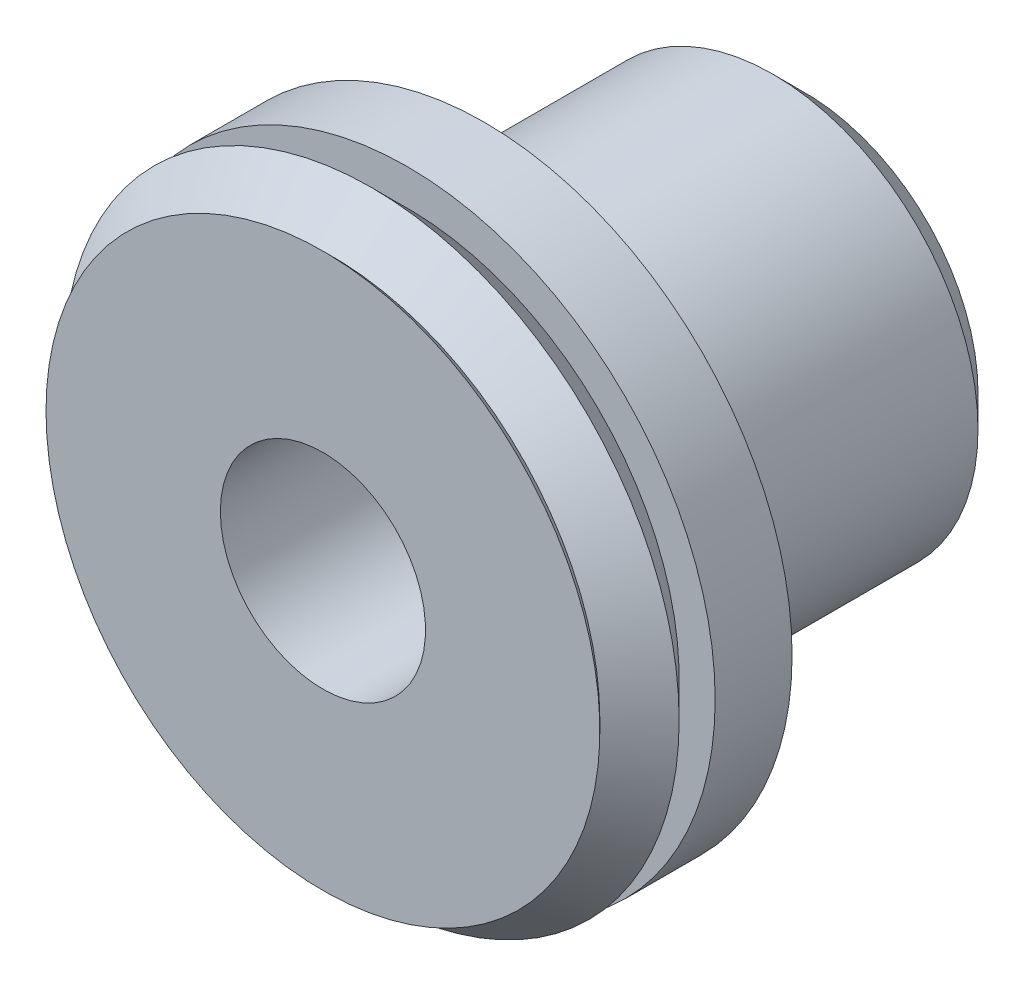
ISO-10303-21;
HEADER;
FILE_DESCRIPTION(('STEP AP214'),'2;1');
FILE_NAME('part.step','',(''),(''),'','','');
FILE_SCHEMA(('AUTOMOTIVE_DESIGN { 1 0 10303 214 1 1 1 1 }'));
ENDSEC;
DATA;
#1=APPLICATION_CONTEXT('core data for automotive mechanical design processes');
#2=APPLICATION_PROTOCOL_DEFINITION('international standard','automotive_design',2000,#1);
#3=PRODUCT_CONTEXT('',#1,'mechanical');
#4=PRODUCT('Part','Part','',(#3));
#5=PRODUCT_RELATED_PRODUCT_CATEGORY('part','',(#4));
#6=PRODUCT_DEFINITION_FORMATION('','',#4);
#7=PRODUCT_DEFINITION_CONTEXT('part definition',#1,'design');
#8=PRODUCT_DEFINITION('design','',#6,#7);
#9=PRODUCT_DEFINITION_SHAPE('','',#8);
#10=(LENGTH_UNIT() NAMED_UNIT(*) SI_UNIT(.MILLI.,.METRE.));
#11=(NAMED_UNIT(*) PLANE_ANGLE_UNIT() SI_UNIT($,.RADIAN.));
#12=(NAMED_UNIT(*) SI_UNIT($,.STERADIAN.) SOLID_ANGLE_UNIT());
#13=UNCERTAINTY_MEASURE_WITH_UNIT(LENGTH_MEASURE(1.E-05),#10,'distance_accuracy_value','');
#14=(GEOMETRIC_REPRESENTATION_CONTEXT(3) GLOBAL_UNCERTAINTY_ASSIGNED_CONTEXT((#13)) GLOBAL_UNIT_ASSIGNED_CONTEXT((#10,
#11,#12)) REPRESENTATION_CONTEXT('',''));
#15=CARTESIAN_POINT('',(0.,0.,0.));
#16=DIRECTION('',(0.,0.,1.));
#17=DIRECTION('',(1.,0.,0.));
#18=AXIS2_PLACEMENT_3D('',#15,#16,#17);
#19=CARTESIAN_POINT('',(0.,0.,0.));
#20=DIRECTION('',(0.,0.,1.));
#21=DIRECTION('',(1.,0.,0.));
#22=AXIS2_PLACEMENT_3D('',#19,#20,#21);
#23=PLANE('',#22);
#24=CARTESIAN_POINT('',(0.,0.,0.));
#25=DIRECTION('',(0.,0.,-1.));
#26=DIRECTION('',(-1.,0.,0.));
#27=AXIS2_PLACEMENT_3D('',#24,#25,#26);
#28=CIRCLE('',#27,6.858);
#29=CARTESIAN_POINT('',(-6.858,0.,0.));
#30=VERTEX_POINT('',#29);
#31=EDGE_CURVE('E48',#30,#30,#28,.T.);
#32=ORIENTED_EDGE('',*,*,#31,.F.);
#33=EDGE_LOOP('',(#32));
#34=FACE_BOUND('',#33,.T.);
#35=CARTESIAN_POINT('',(0.,0.,0.));
#36=DIRECTION('',(0.,0.,-1.));
#37=DIRECTION('',(-1.,0.,0.));
#38=AXIS2_PLACEMENT_3D('',#35,#36,#37);
#39=CIRCLE('',#38,2.54);
#40=CARTESIAN_POINT('',(-2.54,0.,0.));
#41=VERTEX_POINT('',#40);
#42=EDGE_CURVE('E69',#41,#41,#39,.T.);
#43=ORIENTED_EDGE('',*,*,#42,.T.);
#44=EDGE_LOOP('',(#43));
#45=FACE_BOUND('',#44,.T.);
#46=ADVANCED_FACE('F33',(#34,#45),#23,.T.);
#47=CARTESIAN_POINT('',(0.,0.,-11.935714));
#48=DIRECTION('',(0.,0.,1.));
#49=DIRECTION('',(1.,0.,0.));
#50=AXIS2_PLACEMENT_3D('',#47,#48,#49);
#51=PLANE('',#50);
#52=CARTESIAN_POINT('',(0.,0.,-11.935714));
#53=DIRECTION('',(0.,0.,1.));
#54=DIRECTION('',(1.,0.,0.));
#55=AXIS2_PLACEMENT_3D('',#52,#53,#54);
#56=CIRCLE('',#55,4.28625);
#57=CARTESIAN_POINT('',(4.28625,0.,-11.935714));
#58=VERTEX_POINT('',#57);
#59=EDGE_CURVE('E10',#58,#58,#56,.F.);
#60=ORIENTED_EDGE('',*,*,#59,.T.);
#61=EDGE_LOOP('',(#60));
#62=FACE_BOUND('',#61,.T.);
#63=CARTESIAN_POINT('',(0.,0.,-11.935714));
#64=DIRECTION('',(0.,0.,-1.));
#65=DIRECTION('',(-1.,0.,0.));
#66=AXIS2_PLACEMENT_3D('',#63,#64,#65);
#67=CIRCLE('',#66,2.54);
#68=CARTESIAN_POINT('',(-2.54,0.,-11.935714));
#69=VERTEX_POINT('',#68);
#70=EDGE_CURVE('E68',#69,#69,#67,.T.);
#71=ORIENTED_EDGE('',*,*,#70,.F.);
#72=EDGE_LOOP('',(#71));
#73=FACE_BOUND('',#72,.T.);
#74=ADVANCED_FACE('F78',(#62,#73),#51,.F.);
#75=CARTESIAN_POINT('',(0.,0.,-0.219709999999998));
#76=DIRECTION('',(0.,0.,1.));
#77=DIRECTION('',(1.,0.,0.));
#78=AXIS2_PLACEMENT_3D('',#75,#76,#77);
#79=CONICAL_SURFACE('',#78,6.63829,0.785398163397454);
#80=ORIENTED_EDGE('',*,*,#31,.T.);
#81=EDGE_LOOP('',(#80));
#82=FACE_BOUND('',#81,.T.);
#83=CARTESIAN_POINT('',(0.,0.,-0.219709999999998));
#84=DIRECTION('',(0.,0.,-1.));
#85=DIRECTION('',(-1.,0.,0.));
#86=AXIS2_PLACEMENT_3D('',#83,#84,#85);
#87=CIRCLE('',#86,6.63829);
#88=CARTESIAN_POINT('',(-6.63829,0.,-0.219709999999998));
#89=VERTEX_POINT('',#88);
#90=EDGE_CURVE('E53',#89,#89,#87,.T.);
#91=ORIENTED_EDGE('',*,*,#90,.F.);
#92=EDGE_LOOP('',(#91));
#93=FACE_BOUND('',#92,.T.);
#94=ADVANCED_FACE('F80',(#82,#93),#79,.T.);
#95=CARTESIAN_POINT('',(0.,0.,-1.20141999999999));
#96=DIRECTION('',(0.,0.,-1.));
#97=DIRECTION('',(-1.,0.,0.));
#98=AXIS2_PLACEMENT_3D('',#95,#96,#97);
#99=CONICAL_SURFACE('',#98,7.61999999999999,0.785398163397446);
#100=ORIENTED_EDGE('',*,*,#90,.T.);
#101=EDGE_LOOP('',(#100));
#102=FACE_BOUND('',#101,.T.);
#103=CARTESIAN_POINT('',(0.,0.,-1.20141999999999));
#104=DIRECTION('',(0.,0.,-1.));
#105=DIRECTION('',(-1.,0.,0.));
#106=AXIS2_PLACEMENT_3D('',#103,#104,#105);
#107=CIRCLE('',#106,7.61999999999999);
#108=CARTESIAN_POINT('',(-7.61999999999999,0.,-1.20141999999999));
#109=VERTEX_POINT('',#108);
#110=EDGE_CURVE('E56',#109,#109,#107,.T.);
#111=ORIENTED_EDGE('',*,*,#110,.F.);
#112=EDGE_LOOP('',(#111));
#113=FACE_BOUND('',#112,.T.);
#114=ADVANCED_FACE('F86',(#102,#113),#99,.T.);
#115=CARTESIAN_POINT('',(0.,0.,-2.093214));
#116=DIRECTION('',(0.,0.,1.));
#117=DIRECTION('',(1.,0.,0.));
#118=AXIS2_PLACEMENT_3D('',#115,#116,#117);
#119=CONICAL_SURFACE('',#118,6.72820599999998,0.785398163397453);
#120=ORIENTED_EDGE('',*,*,#110,.T.);
#121=EDGE_LOOP('',(#120));
#122=FACE_BOUND('',#121,.T.);
#123=CARTESIAN_POINT('',(0.,0.,-2.093214));
#124=DIRECTION('',(0.,0.,-1.));
#125=DIRECTION('',(-1.,0.,0.));
#126=AXIS2_PLACEMENT_3D('',#123,#124,#125);
#127=CIRCLE('',#126,6.72820599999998);
#128=CARTESIAN_POINT('',(-6.72820599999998,0.,-2.093214));
#129=VERTEX_POINT('',#128);
#130=EDGE_CURVE('E59',#129,#129,#127,.T.);
#131=ORIENTED_EDGE('',*,*,#130,.F.);
#132=EDGE_LOOP('',(#131));
#133=FACE_BOUND('',#132,.T.);
#134=ADVANCED_FACE('F106',(#122,#133),#119,.T.);
#135=CARTESIAN_POINT('',(0.,6.72820599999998,-2.093214));
#136=DIRECTION('',(0.,0.,1.));
#137=DIRECTION('',(1.,0.,0.));
#138=AXIS2_PLACEMENT_3D('',#135,#136,#137);
#139=PLANE('',#138);
#140=ORIENTED_EDGE('',*,*,#130,.T.);
#141=EDGE_LOOP('',(#140));
#142=FACE_BOUND('',#141,.T.);
#143=CARTESIAN_POINT('',(0.,0.,-2.093214));
#144=DIRECTION('',(0.,0.,-1.));
#145=DIRECTION('',(-1.,0.,0.));
#146=AXIS2_PLACEMENT_3D('',#143,#144,#145);
#147=CIRCLE('',#146,7.61999999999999);
#148=CARTESIAN_POINT('',(-7.61999999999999,0.,-2.093214));
#149=VERTEX_POINT('',#148);
#150=EDGE_CURVE('E62',#149,#149,#147,.T.);
#151=ORIENTED_EDGE('',*,*,#150,.F.);
#152=EDGE_LOOP('',(#151));
#153=FACE_BOUND('',#152,.T.);
#154=ADVANCED_FACE('F102',(#142,#153),#139,.T.);
#155=CARTESIAN_POINT('',(0.,0.,-71.2941240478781));
#156=DIRECTION('',(0.,0.,-1.));
#157=DIRECTION('',(-1.,0.,0.));
#158=AXIS2_PLACEMENT_3D('',#155,#156,#157);
#159=CYLINDRICAL_SURFACE('',#158,7.61999999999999);
#160=ORIENTED_EDGE('',*,*,#150,.T.);
#161=EDGE_LOOP('',(#160));
#162=FACE_BOUND('',#161,.T.);
#163=CARTESIAN_POINT('',(0.,0.,-3.998214));
#164=DIRECTION('',(0.,0.,-1.));
#165=DIRECTION('',(-1.,0.,0.));
#166=AXIS2_PLACEMENT_3D('',#163,#164,#165);
#167=CIRCLE('',#166,7.61999999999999);
#168=CARTESIAN_POINT('',(-7.61999999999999,0.,-3.998214));
#169=VERTEX_POINT('',#168);
#170=EDGE_CURVE('E65',#169,#169,#167,.T.);
#171=ORIENTED_EDGE('',*,*,#170,.F.);
#172=EDGE_LOOP('',(#171));
#173=FACE_BOUND('',#172,.T.);
#174=ADVANCED_FACE('F98',(#162,#173),#159,.T.);
#175=CARTESIAN_POINT('',(0.,7.61999999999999,-3.998214));
#176=DIRECTION('',(0.,0.,-1.));
#177=DIRECTION('',(-1.,0.,0.));
#178=AXIS2_PLACEMENT_3D('',#175,#176,#177);
#179=PLANE('',#178);
#180=CARTESIAN_POINT('',(0.,0.,-3.998214));
#181=DIRECTION('',(0.,0.,-1.));
#182=DIRECTION('',(-1.,0.,0.));
#183=AXIS2_PLACEMENT_3D('',#180,#181,#182);
#184=CIRCLE('',#183,5.08);
#185=CARTESIAN_POINT('',(-5.08,0.,-3.998214));
#186=VERTEX_POINT('',#185);
#187=EDGE_CURVE('E44',#186,#186,#184,.T.);
#188=ORIENTED_EDGE('',*,*,#187,.F.);
#189=EDGE_LOOP('',(#188));
#190=FACE_BOUND('',#189,.T.);
#191=ORIENTED_EDGE('',*,*,#170,.T.);
#192=EDGE_LOOP('',(#191));
#193=FACE_BOUND('',#192,.T.);
#194=ADVANCED_FACE('F95',(#190,#193),#179,.T.);
#195=CARTESIAN_POINT('',(0.,0.,-11.935714));
#196=DIRECTION('',(0.,0.,1.));
#197=DIRECTION('',(1.,0.,0.));
#198=AXIS2_PLACEMENT_3D('',#195,#196,#197);
#199=CYLINDRICAL_SURFACE('',#198,5.08);
#200=CARTESIAN_POINT('',(0.,0.,-11.141964));
#201=DIRECTION('',(0.,0.,1.));
#202=DIRECTION('',(1.,0.,0.));
#203=AXIS2_PLACEMENT_3D('',#200,#201,#202);
#204=CIRCLE('',#203,5.08);
#205=CARTESIAN_POINT('',(5.08,0.,-11.141964));
#206=VERTEX_POINT('',#205);
#207=EDGE_CURVE('E40',#206,#206,#204,.T.);
#208=ORIENTED_EDGE('',*,*,#207,.T.);
#209=EDGE_LOOP('',(#208));
#210=FACE_BOUND('',#209,.T.);
#211=ORIENTED_EDGE('',*,*,#187,.T.);
#212=EDGE_LOOP('',(#211));
#213=FACE_BOUND('',#212,.T.);
#214=ADVANCED_FACE('F92',(#210,#213),#199,.T.);
#215=CARTESIAN_POINT('',(0.,0.,-11.141964));
#216=DIRECTION('',(0.,0.,1.));
#217=DIRECTION('',(1.,0.,0.));
#218=AXIS2_PLACEMENT_3D('',#215,#216,#217);
#219=CONICAL_SURFACE('',#218,5.08,0.785398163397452);
#220=ORIENTED_EDGE('',*,*,#59,.F.);
#221=EDGE_LOOP('',(#220));
#222=FACE_BOUND('',#221,.T.);
#223=ORIENTED_EDGE('',*,*,#207,.F.);
#224=EDGE_LOOP('',(#223));
#225=FACE_BOUND('',#224,.T.);
#226=ADVANCED_FACE('F35',(#222,#225),#219,.T.);
#227=CARTESIAN_POINT('',(0.,0.,-11.935714));
#228=DIRECTION('',(0.,0.,1.));
#229=DIRECTION('',(1.,0.,0.));
#230=AXIS2_PLACEMENT_3D('',#227,#228,#229);
#231=CYLINDRICAL_SURFACE('',#230,2.54);
#232=ORIENTED_EDGE('',*,*,#70,.T.);
#233=EDGE_LOOP('',(#232));
#234=FACE_BOUND('',#233,.T.);
#235=ORIENTED_EDGE('',*,*,#42,.F.);
#236=EDGE_LOOP('',(#235));
#237=FACE_BOUND('',#236,.T.);
#238=ADVANCED_FACE('F75',(#234,#237),#231,.F.);
#239=CLOSED_SHELL('',(#46,#74,#94,#114,#134,#154,#174,#194,#214,#226,#238));
#240=MANIFOLD_SOLID_BREP('B2',#239);
#241=ADVANCED_BREP_SHAPE_REPRESENTATION('',(#18,#240),#14);
#242=SHAPE_DEFINITION_REPRESENTATION(#9,#241);
ENDSEC;
END-ISO-10303-21;
